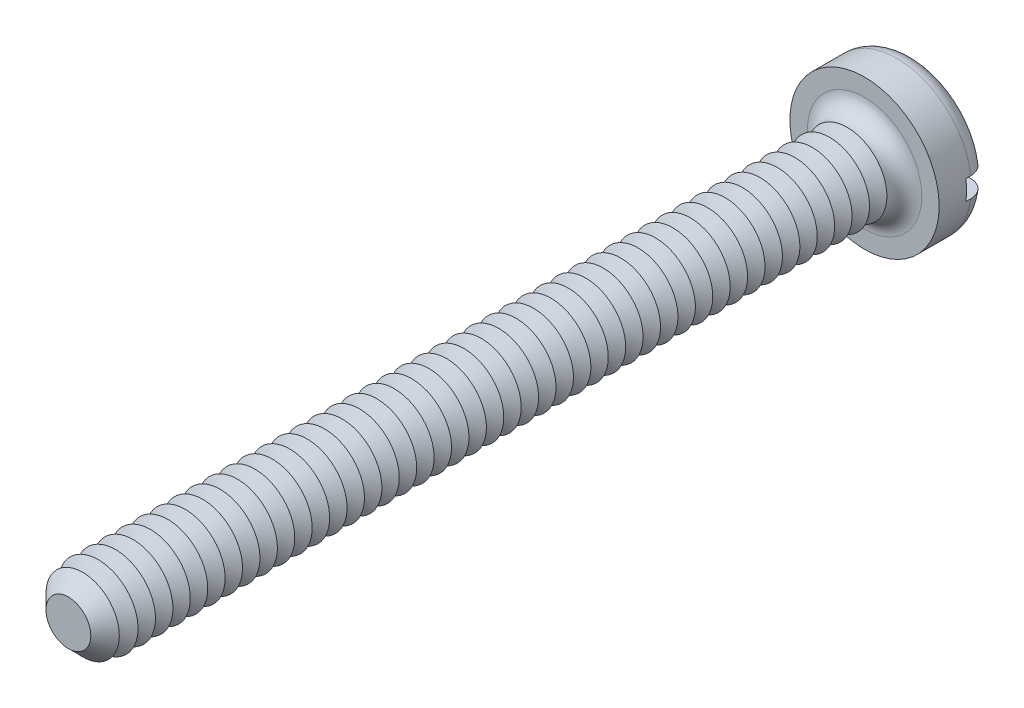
from build123d import *

# Parameters (mm, degrees)
SKETCH3_R           = 1.5
BOSS_EXTRUDE2_DEPTH = 1
SKETCH4_R           = 0.8
BOSS_EXTRUDE3_DEPTH = 16
FILLET1_R           = 0.35
CHAMFER1_SIZE       = 0.35
LPATTERN1_COUNT     = 44
LPATTERN1_PITCH     = 0.35
SKETCH8_W           = 3
SKETCH8_H           = 0.4
CUT_EXTRUDE1_DEPTH  = 0.45


with BuildPart() as part:
    # Sketch3 → Boss-Extrude2 (new body)
    with BuildSketch(Plane.XY):
        Circle(SKETCH3_R)
    extrude(amount=-BOSS_EXTRUDE2_DEPTH)

    # Sketch4 → Boss-Extrude3 (add)
    with BuildSketch(Plane.XY):
        Circle(SKETCH4_R)
    extrude(amount=BOSS_EXTRUDE3_DEPTH)

    # Fillet1
    fillet1_edges = [part.edges().sort_by_distance(p)[0] for p in [
        (-1.5, 0, -1),
        (-0.8, 0, 0),
    ]]
    fillet(fillet1_edges, radius=FILLET1_R)

    # Chamfer1
    chamfer1_edges = [part.edges().sort_by_distance(p)[0] for p in [
        (-0.8, 0, 16),
    ]]
    chamfer(chamfer1_edges, length=CHAMFER1_SIZE)

    # Sketch6 → Cut-Revolve1 (revolve, cut)
    with BuildSketch(Plane(origin=(0, 0, 0), x_dir=(0, 0, -1), z_dir=(1, 0, 0)), mode=Mode.PRIVATE) as cut_revolve1_sk:
        Polygon((-0.35, 0.8), (-0.525, 0.496891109), (-0.7, 0.8), align=None)
    cut_revolve1 = revolve(cut_revolve1_sk.sketch.rotate(Axis((0, 0, -1.694361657), (0, 0, 1)), 90), axis=Axis((0, 0, -1.694361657), (0, 0, 1)), mode=Mode.SUBTRACT)

    # LPattern1: Cut-Revolve1 ×44
    with Locations(*[(0, 0, i * LPATTERN1_PITCH) for i in range(1, LPATTERN1_COUNT)]):
        add(cut_revolve1, mode=Mode.SUBTRACT)

    # Sketch8 → Cut-Extrude1 (cut)
    with BuildSketch(Plane(origin=(0, 0, -1), x_dir=(-1, 0, 0), z_dir=(0, 0, -1))):
        Rectangle(SKETCH8_W, SKETCH8_H)
    extrude(amount=-CUT_EXTRUDE1_DEPTH, mode=Mode.SUBTRACT)


solid = part.part
